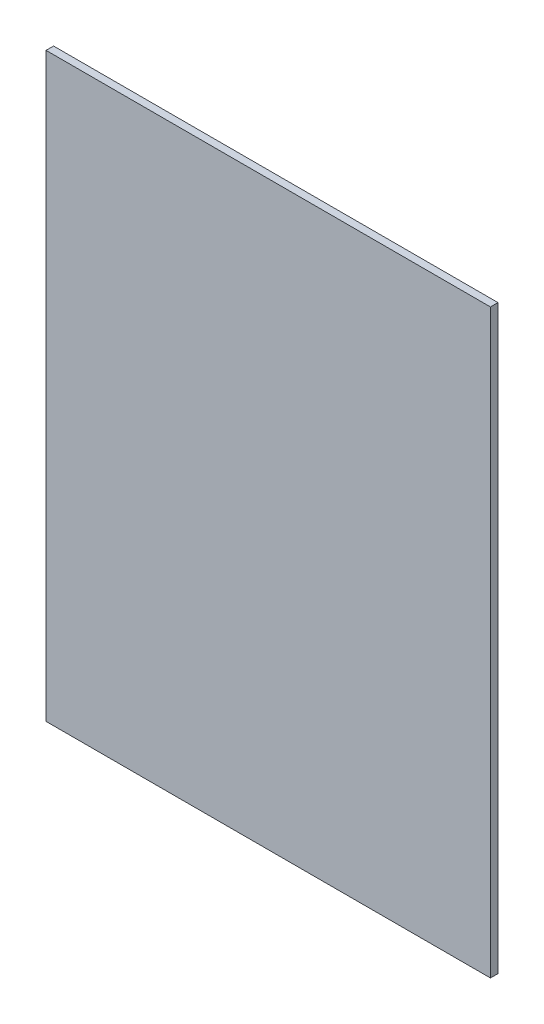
from build123d import *

# Parameters (mm, degrees)
SKETCH1_W           = 165.1
SKETCH1_H           = 215.9
BOSS_EXTRUDE1_DEPTH = 2.794


with BuildPart() as part:
    # Sketch1 → Boss-Extrude1 (new body)
    with BuildSketch(Plane.XY):
        Rectangle(SKETCH1_W, SKETCH1_H)
    extrude(amount=BOSS_EXTRUDE1_DEPTH)


solid = part.part
